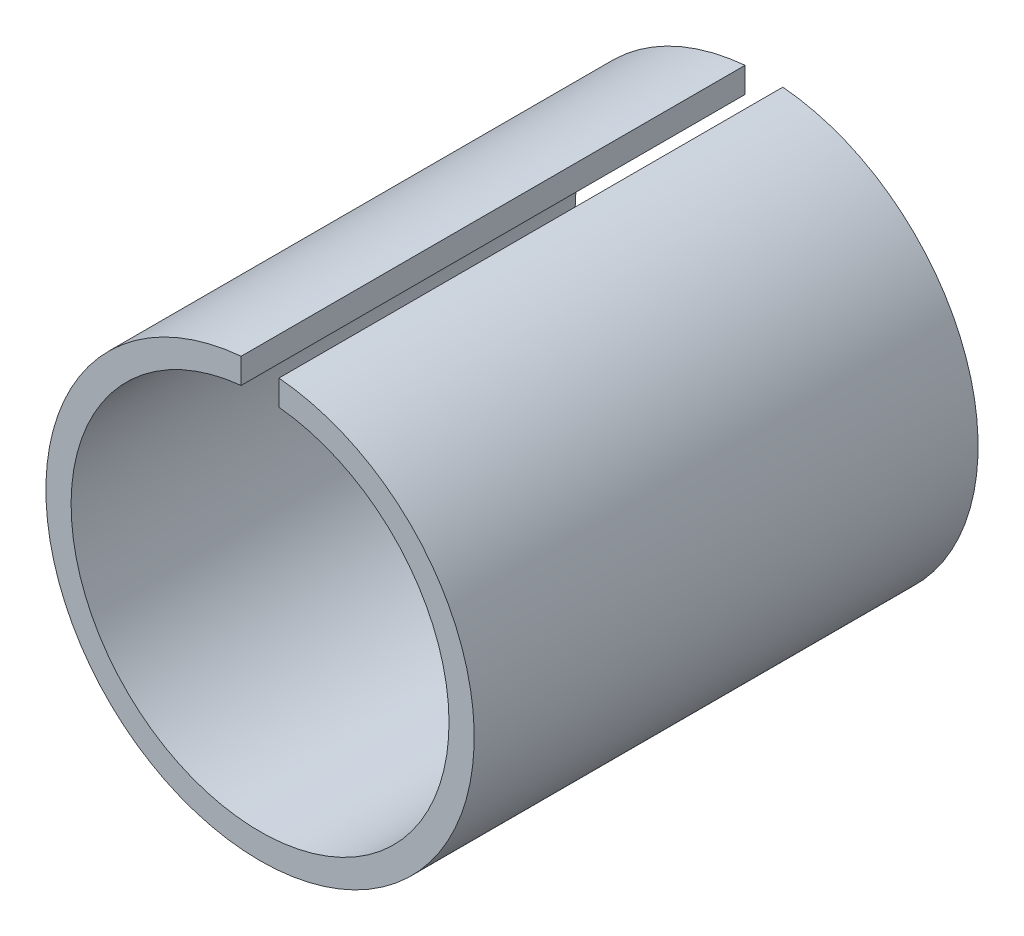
ISO-10303-21;
HEADER;
FILE_DESCRIPTION(('STEP AP214'),'2;1');
FILE_NAME('part.step','',(''),(''),'','','');
FILE_SCHEMA(('AUTOMOTIVE_DESIGN { 1 0 10303 214 1 1 1 1 }'));
ENDSEC;
DATA;
#1=APPLICATION_CONTEXT('core data for automotive mechanical design processes');
#2=APPLICATION_PROTOCOL_DEFINITION('international standard','automotive_design',2000,#1);
#3=PRODUCT_CONTEXT('',#1,'mechanical');
#4=PRODUCT('Part','Part','',(#3));
#5=PRODUCT_RELATED_PRODUCT_CATEGORY('part','',(#4));
#6=PRODUCT_DEFINITION_FORMATION('','',#4);
#7=PRODUCT_DEFINITION_CONTEXT('part definition',#1,'design');
#8=PRODUCT_DEFINITION('design','',#6,#7);
#9=PRODUCT_DEFINITION_SHAPE('','',#8);
#10=(LENGTH_UNIT() NAMED_UNIT(*) SI_UNIT(.MILLI.,.METRE.));
#11=(NAMED_UNIT(*) PLANE_ANGLE_UNIT() SI_UNIT($,.RADIAN.));
#12=(NAMED_UNIT(*) SI_UNIT($,.STERADIAN.) SOLID_ANGLE_UNIT());
#13=UNCERTAINTY_MEASURE_WITH_UNIT(LENGTH_MEASURE(1.E-05),#10,'distance_accuracy_value','');
#14=(GEOMETRIC_REPRESENTATION_CONTEXT(3) GLOBAL_UNCERTAINTY_ASSIGNED_CONTEXT((#13)) GLOBAL_UNIT_ASSIGNED_CONTEXT((#10,
#11,#12)) REPRESENTATION_CONTEXT('',''));
#15=CARTESIAN_POINT('',(0.,0.,0.));
#16=DIRECTION('',(0.,0.,1.));
#17=DIRECTION('',(1.,0.,0.));
#18=AXIS2_PLACEMENT_3D('',#15,#16,#17);
#19=CARTESIAN_POINT('',(0.750000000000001,10.5003856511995,-15.));
#20=DIRECTION('',(1.,0.,0.));
#21=DIRECTION('',(0.,1.,0.));
#22=AXIS2_PLACEMENT_3D('',#19,#20,#21);
#23=PLANE('',#22);
#24=DIRECTION('',(0.,0.,-1.));
#25=VECTOR('',#24,1.);
#26=CARTESIAN_POINT('',(0.750000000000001,7.46240577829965,10.));
#27=LINE('',#26,#25);
#28=CARTESIAN_POINT('',(0.750000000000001,7.46240577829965,-10.));
#29=VERTEX_POINT('',#28);
#30=CARTESIAN_POINT('',(0.750000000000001,7.46240577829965,10.));
#31=VERTEX_POINT('',#30);
#32=EDGE_CURVE('E71',#29,#31,#27,.F.);
#33=ORIENTED_EDGE('',*,*,#32,.T.);
#34=DIRECTION('',(0.,1.,0.));
#35=VECTOR('',#34,1.);
#36=CARTESIAN_POINT('',(0.750000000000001,10.5003856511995,10.));
#37=LINE('',#36,#35);
#38=CARTESIAN_POINT('',(0.750000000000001,8.46684711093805,10.));
#39=VERTEX_POINT('',#38);
#40=EDGE_CURVE('E58',#39,#31,#37,.F.);
#41=ORIENTED_EDGE('',*,*,#40,.F.);
#42=DIRECTION('',(0.,0.,-1.));
#43=VECTOR('',#42,1.);
#44=CARTESIAN_POINT('',(0.750000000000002,8.46684711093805,10.));
#45=LINE('',#44,#43);
#46=CARTESIAN_POINT('',(0.750000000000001,8.46684711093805,-10.));
#47=VERTEX_POINT('',#46);
#48=EDGE_CURVE('E70',#47,#39,#45,.F.);
#49=ORIENTED_EDGE('',*,*,#48,.F.);
#50=DIRECTION('',(0.,1.,0.));
#51=VECTOR('',#50,1.);
#52=CARTESIAN_POINT('',(0.750000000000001,10.5003856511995,-10.));
#53=LINE('',#52,#51);
#54=EDGE_CURVE('E72',#29,#47,#53,.T.);
#55=ORIENTED_EDGE('',*,*,#54,.F.);
#56=EDGE_LOOP('',(#33,#41,#49,#55));
#57=FACE_BOUND('',#56,.T.);
#58=ADVANCED_FACE('F16',(#57),#23,.F.);
#59=CARTESIAN_POINT('',(-0.749999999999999,10.5003856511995,-15.));
#60=DIRECTION('',(-1.,0.,0.));
#61=DIRECTION('',(0.,-1.,0.));
#62=AXIS2_PLACEMENT_3D('',#59,#60,#61);
#63=PLANE('',#62);
#64=DIRECTION('',(0.,0.,-1.));
#65=VECTOR('',#64,1.);
#66=CARTESIAN_POINT('',(-0.749999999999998,7.46240577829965,10.));
#67=LINE('',#66,#65);
#68=CARTESIAN_POINT('',(-0.749999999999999,7.46240577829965,10.));
#69=VERTEX_POINT('',#68);
#70=CARTESIAN_POINT('',(-0.749999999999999,7.46240577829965,-10.));
#71=VERTEX_POINT('',#70);
#72=EDGE_CURVE('E75',#69,#71,#67,.T.);
#73=ORIENTED_EDGE('',*,*,#72,.T.);
#74=DIRECTION('',(0.,-1.,0.));
#75=VECTOR('',#74,1.);
#76=CARTESIAN_POINT('',(-0.749999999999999,10.5003856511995,-10.));
#77=LINE('',#76,#75);
#78=CARTESIAN_POINT('',(-0.749999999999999,8.46684711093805,-10.));
#79=VERTEX_POINT('',#78);
#80=EDGE_CURVE('E82',#79,#71,#77,.T.);
#81=ORIENTED_EDGE('',*,*,#80,.F.);
#82=DIRECTION('',(0.,0.,-1.));
#83=VECTOR('',#82,1.);
#84=CARTESIAN_POINT('',(-0.749999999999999,8.46684711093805,10.));
#85=LINE('',#84,#83);
#86=CARTESIAN_POINT('',(-0.749999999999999,8.46684711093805,10.));
#87=VERTEX_POINT('',#86);
#88=EDGE_CURVE('E85',#87,#79,#85,.T.);
#89=ORIENTED_EDGE('',*,*,#88,.F.);
#90=DIRECTION('',(0.,1.,0.));
#91=VECTOR('',#90,1.);
#92=CARTESIAN_POINT('',(-0.749999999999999,0.,10.));
#93=LINE('',#92,#91);
#94=EDGE_CURVE('E60',#69,#87,#93,.T.);
#95=ORIENTED_EDGE('',*,*,#94,.F.);
#96=EDGE_LOOP('',(#73,#81,#89,#95));
#97=FACE_BOUND('',#96,.T.);
#98=ADVANCED_FACE('F88',(#97),#63,.F.);
#99=CARTESIAN_POINT('',(0.,0.,10.));
#100=DIRECTION('',(0.,0.,-1.));
#101=DIRECTION('',(-1.,0.,0.));
#102=AXIS2_PLACEMENT_3D('',#99,#100,#101);
#103=CYLINDRICAL_SURFACE('',#102,7.5);
#104=CARTESIAN_POINT('',(0.,0.,10.));
#105=DIRECTION('',(0.,0.,-1.));
#106=DIRECTION('',(-1.,0.,0.));
#107=AXIS2_PLACEMENT_3D('',#104,#105,#106);
#108=CIRCLE('',#107,7.5);
#109=EDGE_CURVE('E19',#31,#69,#108,.T.);
#110=ORIENTED_EDGE('',*,*,#109,.F.);
#111=ORIENTED_EDGE('',*,*,#32,.F.);
#112=CARTESIAN_POINT('',(0.,0.,-10.));
#113=DIRECTION('',(0.,0.,-1.));
#114=DIRECTION('',(-1.,0.,0.));
#115=AXIS2_PLACEMENT_3D('',#112,#113,#114);
#116=CIRCLE('',#115,7.5);
#117=EDGE_CURVE('E65',#29,#71,#116,.T.);
#118=ORIENTED_EDGE('',*,*,#117,.T.);
#119=ORIENTED_EDGE('',*,*,#72,.F.);
#120=EDGE_LOOP('',(#110,#111,#118,#119));
#121=FACE_BOUND('',#120,.T.);
#122=ADVANCED_FACE('F90',(#121),#103,.F.);
#123=CARTESIAN_POINT('',(0.,0.,10.));
#124=DIRECTION('',(0.,0.,1.));
#125=DIRECTION('',(1.,0.,0.));
#126=AXIS2_PLACEMENT_3D('',#123,#124,#125);
#127=PLANE('',#126);
#128=ORIENTED_EDGE('',*,*,#40,.T.);
#129=ORIENTED_EDGE('',*,*,#109,.T.);
#130=ORIENTED_EDGE('',*,*,#94,.T.);
#131=CARTESIAN_POINT('',(0.,0.,10.));
#132=DIRECTION('',(0.,0.,-1.));
#133=DIRECTION('',(-1.,0.,0.));
#134=AXIS2_PLACEMENT_3D('',#131,#132,#133);
#135=CIRCLE('',#134,8.5);
#136=EDGE_CURVE('E25',#39,#87,#135,.T.);
#137=ORIENTED_EDGE('',*,*,#136,.F.);
#138=EDGE_LOOP('',(#128,#129,#130,#137));
#139=FACE_BOUND('',#138,.T.);
#140=ADVANCED_FACE('F57',(#139),#127,.T.);
#141=CARTESIAN_POINT('',(0.,0.,-10.));
#142=DIRECTION('',(0.,0.,1.));
#143=DIRECTION('',(1.,0.,0.));
#144=AXIS2_PLACEMENT_3D('',#141,#142,#143);
#145=PLANE('',#144);
#146=ORIENTED_EDGE('',*,*,#80,.T.);
#147=ORIENTED_EDGE('',*,*,#117,.F.);
#148=ORIENTED_EDGE('',*,*,#54,.T.);
#149=CARTESIAN_POINT('',(0.,0.,-10.));
#150=DIRECTION('',(0.,0.,-1.));
#151=DIRECTION('',(-1.,0.,0.));
#152=AXIS2_PLACEMENT_3D('',#149,#150,#151);
#153=CIRCLE('',#152,8.5);
#154=EDGE_CURVE('E11',#79,#47,#153,.F.);
#155=ORIENTED_EDGE('',*,*,#154,.F.);
#156=EDGE_LOOP('',(#146,#147,#148,#155));
#157=FACE_BOUND('',#156,.T.);
#158=ADVANCED_FACE('F89',(#157),#145,.F.);
#159=CARTESIAN_POINT('',(0.,0.,10.));
#160=DIRECTION('',(0.,0.,-1.));
#161=DIRECTION('',(-1.,0.,0.));
#162=AXIS2_PLACEMENT_3D('',#159,#160,#161);
#163=CYLINDRICAL_SURFACE('',#162,8.5);
#164=ORIENTED_EDGE('',*,*,#136,.T.);
#165=ORIENTED_EDGE('',*,*,#88,.T.);
#166=ORIENTED_EDGE('',*,*,#154,.T.);
#167=ORIENTED_EDGE('',*,*,#48,.T.);
#168=EDGE_LOOP('',(#164,#165,#166,#167));
#169=FACE_BOUND('',#168,.T.);
#170=ADVANCED_FACE('F74',(#169),#163,.T.);
#171=CLOSED_SHELL('',(#58,#98,#122,#140,#158,#170));
#172=MANIFOLD_SOLID_BREP('B1',#171);
#173=ADVANCED_BREP_SHAPE_REPRESENTATION('',(#18,#172),#14);
#174=SHAPE_DEFINITION_REPRESENTATION(#9,#173);
ENDSEC;
END-ISO-10303-21;
